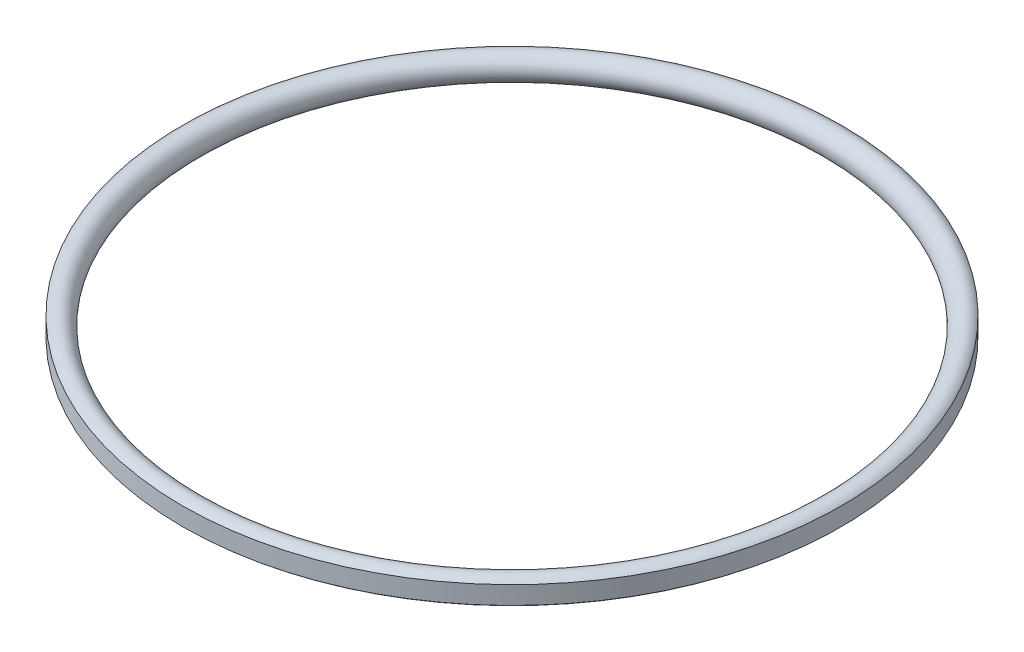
ISO-10303-21;
HEADER;
FILE_DESCRIPTION(('STEP AP214'),'2;1');
FILE_NAME('part.step','',(''),(''),'','','');
FILE_SCHEMA(('AUTOMOTIVE_DESIGN { 1 0 10303 214 1 1 1 1 }'));
ENDSEC;
DATA;
#1=APPLICATION_CONTEXT('core data for automotive mechanical design processes');
#2=APPLICATION_PROTOCOL_DEFINITION('international standard','automotive_design',2000,#1);
#3=PRODUCT_CONTEXT('',#1,'mechanical');
#4=PRODUCT('Part','Part','',(#3));
#5=PRODUCT_RELATED_PRODUCT_CATEGORY('part','',(#4));
#6=PRODUCT_DEFINITION_FORMATION('','',#4);
#7=PRODUCT_DEFINITION_CONTEXT('part definition',#1,'design');
#8=PRODUCT_DEFINITION('design','',#6,#7);
#9=PRODUCT_DEFINITION_SHAPE('','',#8);
#10=(LENGTH_UNIT() NAMED_UNIT(*) SI_UNIT(.MILLI.,.METRE.));
#11=(NAMED_UNIT(*) PLANE_ANGLE_UNIT() SI_UNIT($,.RADIAN.));
#12=(NAMED_UNIT(*) SI_UNIT($,.STERADIAN.) SOLID_ANGLE_UNIT());
#13=UNCERTAINTY_MEASURE_WITH_UNIT(LENGTH_MEASURE(1.E-05),#10,'distance_accuracy_value','');
#14=(GEOMETRIC_REPRESENTATION_CONTEXT(3) GLOBAL_UNCERTAINTY_ASSIGNED_CONTEXT((#13)) GLOBAL_UNIT_ASSIGNED_CONTEXT((#10,
#11,#12)) REPRESENTATION_CONTEXT('',''));
#15=CARTESIAN_POINT('',(0.,0.,0.));
#16=DIRECTION('',(0.,0.,1.));
#17=DIRECTION('',(1.,0.,0.));
#18=AXIS2_PLACEMENT_3D('',#15,#16,#17);
#19=CARTESIAN_POINT('',(0.,2.66499999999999,0.));
#20=DIRECTION('',(0.,-1.,0.));
#21=DIRECTION('',(0.,0.,-1.));
#22=AXIS2_PLACEMENT_3D('',#19,#20,#21);
#23=TOROIDAL_SURFACE('',#22,67.015,2.665);
#24=CARTESIAN_POINT('',(0.,0.781121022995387,0.));
#25=DIRECTION('',(0.,1.,0.));
#26=DIRECTION('',(0.,0.,1.));
#27=AXIS2_PLACEMENT_3D('',#24,#25,#26);
#28=CIRCLE('',#27,68.9);
#29=CARTESIAN_POINT('',(0.,0.781121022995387,68.9));
#30=VERTEX_POINT('',#29);
#31=EDGE_CURVE('E11',#30,#30,#28,.F.);
#32=ORIENTED_EDGE('',*,*,#31,.T.);
#33=EDGE_LOOP('',(#32));
#34=FACE_BOUND('',#33,.T.);
#35=CARTESIAN_POINT('',(0.,4.5488789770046,0.));
#36=DIRECTION('',(0.,-1.,0.));
#37=DIRECTION('',(0.,0.,-1.));
#38=AXIS2_PLACEMENT_3D('',#35,#36,#37);
#39=CIRCLE('',#38,68.9);
#40=CARTESIAN_POINT('',(0.,4.5488789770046,-68.9));
#41=VERTEX_POINT('',#40);
#42=EDGE_CURVE('E37',#41,#41,#39,.F.);
#43=ORIENTED_EDGE('',*,*,#42,.T.);
#44=EDGE_LOOP('',(#43));
#45=FACE_BOUND('',#44,.T.);
#46=ADVANCED_FACE('F31',(#34,#45),#23,.T.);
#47=CARTESIAN_POINT('',(0.,33.7,0.));
#48=DIRECTION('',(0.,-1.,0.));
#49=DIRECTION('',(0.,0.,-1.));
#50=AXIS2_PLACEMENT_3D('',#47,#48,#49);
#51=CYLINDRICAL_SURFACE('',#50,68.9);
#52=ORIENTED_EDGE('',*,*,#42,.F.);
#53=EDGE_LOOP('',(#52));
#54=FACE_BOUND('',#53,.T.);
#55=ORIENTED_EDGE('',*,*,#31,.F.);
#56=EDGE_LOOP('',(#55));
#57=FACE_BOUND('',#56,.T.);
#58=ADVANCED_FACE('F44',(#54,#57),#51,.T.);
#59=CLOSED_SHELL('',(#46,#58));
#60=MANIFOLD_SOLID_BREP('B2',#59);
#61=ADVANCED_BREP_SHAPE_REPRESENTATION('',(#18,#60),#14);
#62=SHAPE_DEFINITION_REPRESENTATION(#9,#61);
ENDSEC;
END-ISO-10303-21;
